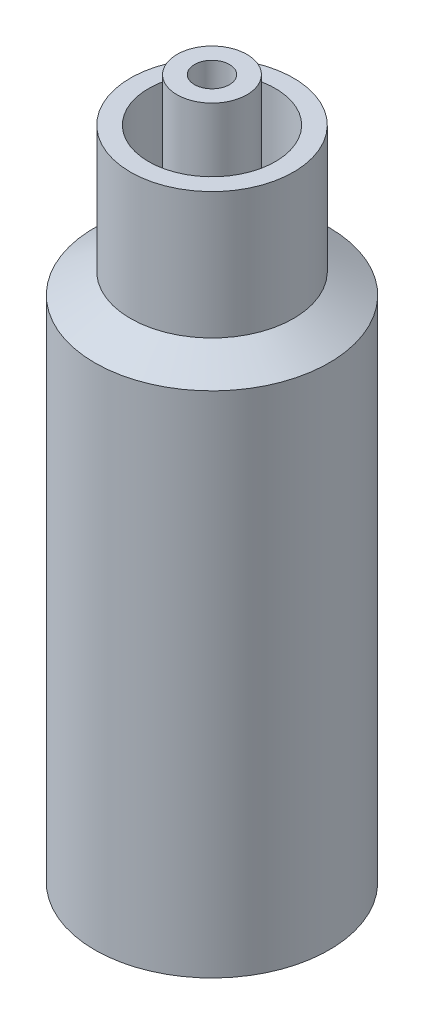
ISO-10303-21;
HEADER;
FILE_DESCRIPTION(('STEP AP214'),'2;1');
FILE_NAME('part.step','',(''),(''),'','','');
FILE_SCHEMA(('AUTOMOTIVE_DESIGN { 1 0 10303 214 1 1 1 1 }'));
ENDSEC;
DATA;
#1=APPLICATION_CONTEXT('core data for automotive mechanical design processes');
#2=APPLICATION_PROTOCOL_DEFINITION('international standard','automotive_design',2000,#1);
#3=PRODUCT_CONTEXT('',#1,'mechanical');
#4=PRODUCT('Part','Part','',(#3));
#5=PRODUCT_RELATED_PRODUCT_CATEGORY('part','',(#4));
#6=PRODUCT_DEFINITION_FORMATION('','',#4);
#7=PRODUCT_DEFINITION_CONTEXT('part definition',#1,'design');
#8=PRODUCT_DEFINITION('design','',#6,#7);
#9=PRODUCT_DEFINITION_SHAPE('','',#8);
#10=(LENGTH_UNIT() NAMED_UNIT(*) SI_UNIT(.MILLI.,.METRE.));
#11=(NAMED_UNIT(*) PLANE_ANGLE_UNIT() SI_UNIT($,.RADIAN.));
#12=(NAMED_UNIT(*) SI_UNIT($,.STERADIAN.) SOLID_ANGLE_UNIT());
#13=UNCERTAINTY_MEASURE_WITH_UNIT(LENGTH_MEASURE(1.E-05),#10,'distance_accuracy_value','');
#14=(GEOMETRIC_REPRESENTATION_CONTEXT(3) GLOBAL_UNCERTAINTY_ASSIGNED_CONTEXT((#13)) GLOBAL_UNIT_ASSIGNED_CONTEXT((#10,
#11,#12)) REPRESENTATION_CONTEXT('',''));
#15=CARTESIAN_POINT('',(0.,0.,0.));
#16=DIRECTION('',(0.,0.,1.));
#17=DIRECTION('',(1.,0.,0.));
#18=AXIS2_PLACEMENT_3D('',#15,#16,#17);
#19=CARTESIAN_POINT('',(-5.715,6.35,0.));
#20=DIRECTION('',(0.,1.,0.));
#21=DIRECTION('',(-1.,0.,0.));
#22=AXIS2_PLACEMENT_3D('',#19,#20,#21);
#23=PLANE('',#22);
#24=CARTESIAN_POINT('',(0.,6.35,0.));
#25=DIRECTION('',(0.,-1.,0.));
#26=DIRECTION('',(1.,0.,0.));
#27=AXIS2_PLACEMENT_3D('',#24,#25,#26);
#28=CIRCLE('',#27,5.715);
#29=CARTESIAN_POINT('',(5.715,6.35,0.));
#30=VERTEX_POINT('',#29);
#31=EDGE_CURVE('E12',#30,#30,#28,.T.);
#32=ORIENTED_EDGE('',*,*,#31,.T.);
#33=EDGE_LOOP('',(#32));
#34=FACE_BOUND('',#33,.T.);
#35=ADVANCED_FACE('F42',(#34),#23,.F.);
#36=CARTESIAN_POINT('',(0.,0.,0.));
#37=DIRECTION('',(0.,-1.,0.));
#38=DIRECTION('',(1.,0.,0.));
#39=AXIS2_PLACEMENT_3D('',#36,#37,#38);
#40=CYLINDRICAL_SURFACE('',#39,5.715);
#41=ORIENTED_EDGE('',*,*,#31,.F.);
#42=EDGE_LOOP('',(#41));
#43=FACE_BOUND('',#42,.T.);
#44=CARTESIAN_POINT('',(0.,10.16,0.));
#45=DIRECTION('',(0.,-1.,0.));
#46=DIRECTION('',(1.,0.,0.));
#47=AXIS2_PLACEMENT_3D('',#44,#45,#46);
#48=CIRCLE('',#47,5.715);
#49=CARTESIAN_POINT('',(5.715,10.16,0.));
#50=VERTEX_POINT('',#49);
#51=EDGE_CURVE('E48',#50,#50,#48,.T.);
#52=ORIENTED_EDGE('',*,*,#51,.T.);
#53=EDGE_LOOP('',(#52));
#54=FACE_BOUND('',#53,.T.);
#55=ADVANCED_FACE('F53',(#43,#54),#40,.T.);
#56=CARTESIAN_POINT('',(0.,12.2400898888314,0.));
#57=DIRECTION('',(0.,-1.,0.));
#58=DIRECTION('',(1.,0.,0.));
#59=AXIS2_PLACEMENT_3D('',#56,#57,#58);
#60=CONICAL_SURFACE('',#59,0.,1.22173047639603);
#61=ORIENTED_EDGE('',*,*,#51,.F.);
#62=EDGE_LOOP('',(#61));
#63=FACE_BOUND('',#62,.T.);
#64=CARTESIAN_POINT('',(0.,12.2400898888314,0.));
#65=VERTEX_POINT('',#64);
#66=VERTEX_LOOP('',#65);
#67=FACE_BOUND('',#66,.T.);
#68=ADVANCED_FACE('F51',(#63,#67),#60,.T.);
#69=CLOSED_SHELL('',(#35,#55,#68));
#70=MANIFOLD_SOLID_BREP('B2',#69);
#71=CARTESIAN_POINT('',(0.,0.,0.));
#72=DIRECTION('',(0.,1.,0.));
#73=DIRECTION('',(0.,0.,1.));
#74=AXIS2_PLACEMENT_3D('',#71,#72,#73);
#75=CYLINDRICAL_SURFACE('',#74,5.7912);
#76=CARTESIAN_POINT('',(0.,28.9522393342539,0.));
#77=DIRECTION('',(0.,1.,0.));
#78=DIRECTION('',(0.,0.,1.));
#79=AXIS2_PLACEMENT_3D('',#76,#77,#78);
#80=CIRCLE('',#79,5.7912);
#81=CARTESIAN_POINT('',(0.,28.9522393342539,-5.7912));
#82=VERTEX_POINT('',#81);
#83=EDGE_CURVE('E124',#82,#82,#80,.T.);
#84=ORIENTED_EDGE('',*,*,#83,.T.);
#85=EDGE_LOOP('',(#84));
#86=FACE_BOUND('',#85,.T.);
#87=CARTESIAN_POINT('',(0.,0.,0.));
#88=DIRECTION('',(0.,1.,0.));
#89=DIRECTION('',(0.,0.,1.));
#90=AXIS2_PLACEMENT_3D('',#87,#88,#89);
#91=CIRCLE('',#90,5.7912);
#92=CARTESIAN_POINT('',(0.,0.,5.7912));
#93=VERTEX_POINT('',#92);
#94=EDGE_CURVE('E41',#93,#93,#91,.T.);
#95=ORIENTED_EDGE('',*,*,#94,.F.);
#96=EDGE_LOOP('',(#95));
#97=FACE_BOUND('',#96,.T.);
#98=ADVANCED_FACE('F84',(#86,#97),#75,.F.);
#99=CARTESIAN_POINT('',(-5.7912,0.,0.));
#100=DIRECTION('',(0.,-1.,0.));
#101=DIRECTION('',(0.,0.,-1.));
#102=AXIS2_PLACEMENT_3D('',#99,#100,#101);
#103=PLANE('',#102);
#104=ORIENTED_EDGE('',*,*,#94,.T.);
#105=EDGE_LOOP('',(#104));
#106=FACE_BOUND('',#105,.T.);
#107=CARTESIAN_POINT('',(0.,0.,0.));
#108=DIRECTION('',(0.,1.,0.));
#109=DIRECTION('',(0.,0.,1.));
#110=AXIS2_PLACEMENT_3D('',#107,#108,#109);
#111=CIRCLE('',#110,6.8072);
#112=CARTESIAN_POINT('',(0.,0.,6.8072));
#113=VERTEX_POINT('',#112);
#114=EDGE_CURVE('E90',#113,#113,#111,.T.);
#115=ORIENTED_EDGE('',*,*,#114,.F.);
#116=EDGE_LOOP('',(#115));
#117=FACE_BOUND('',#116,.T.);
#118=ADVANCED_FACE('F142',(#106,#117),#103,.T.);
#119=CARTESIAN_POINT('',(0.,0.,0.));
#120=DIRECTION('',(0.,1.,0.));
#121=DIRECTION('',(0.,0.,1.));
#122=AXIS2_PLACEMENT_3D('',#119,#120,#121);
#123=CYLINDRICAL_SURFACE('',#122,6.8072);
#124=ORIENTED_EDGE('',*,*,#114,.T.);
#125=EDGE_LOOP('',(#124));
#126=FACE_BOUND('',#125,.T.);
#127=CARTESIAN_POINT('',(0.,29.5388272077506,0.));
#128=DIRECTION('',(0.,1.,0.));
#129=DIRECTION('',(0.,0.,1.));
#130=AXIS2_PLACEMENT_3D('',#127,#128,#129);
#131=CIRCLE('',#130,6.8072);
#132=CARTESIAN_POINT('',(0.,29.5388272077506,6.8072));
#133=VERTEX_POINT('',#132);
#134=EDGE_CURVE('E94',#133,#133,#131,.T.);
#135=ORIENTED_EDGE('',*,*,#134,.F.);
#136=EDGE_LOOP('',(#135));
#137=FACE_BOUND('',#136,.T.);
#138=ADVANCED_FACE('F146',(#126,#137),#123,.T.);
#139=CARTESIAN_POINT('',(0.,30.734,0.));
#140=DIRECTION('',(0.,-1.,0.));
#141=DIRECTION('',(0.,0.,-1.));
#142=AXIS2_PLACEMENT_3D('',#139,#140,#141);
#143=CONICAL_SURFACE('',#142,4.7371,1.0471975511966);
#144=ORIENTED_EDGE('',*,*,#134,.T.);
#145=EDGE_LOOP('',(#144));
#146=FACE_BOUND('',#145,.T.);
#147=CARTESIAN_POINT('',(0.,30.734,0.));
#148=DIRECTION('',(0.,1.,0.));
#149=DIRECTION('',(0.,0.,1.));
#150=AXIS2_PLACEMENT_3D('',#147,#148,#149);
#151=CIRCLE('',#150,4.7371);
#152=CARTESIAN_POINT('',(0.,30.734,4.7371));
#153=VERTEX_POINT('',#152);
#154=EDGE_CURVE('E98',#153,#153,#151,.T.);
#155=ORIENTED_EDGE('',*,*,#154,.F.);
#156=EDGE_LOOP('',(#155));
#157=FACE_BOUND('',#156,.T.);
#158=ADVANCED_FACE('F150',(#146,#157),#143,.T.);
#159=CARTESIAN_POINT('',(0.,0.,0.));
#160=DIRECTION('',(0.,1.,0.));
#161=DIRECTION('',(0.,0.,1.));
#162=AXIS2_PLACEMENT_3D('',#159,#160,#161);
#163=CYLINDRICAL_SURFACE('',#162,4.7371);
#164=ORIENTED_EDGE('',*,*,#154,.T.);
#165=EDGE_LOOP('',(#164));
#166=FACE_BOUND('',#165,.T.);
#167=CARTESIAN_POINT('',(0.,38.1,0.));
#168=DIRECTION('',(0.,1.,0.));
#169=DIRECTION('',(0.,0.,1.));
#170=AXIS2_PLACEMENT_3D('',#167,#168,#169);
#171=CIRCLE('',#170,4.7371);
#172=CARTESIAN_POINT('',(0.,38.1,4.7371));
#173=VERTEX_POINT('',#172);
#174=EDGE_CURVE('E103',#173,#173,#171,.T.);
#175=ORIENTED_EDGE('',*,*,#174,.F.);
#176=EDGE_LOOP('',(#175));
#177=FACE_BOUND('',#176,.T.);
#178=ADVANCED_FACE('F156',(#166,#177),#163,.T.);
#179=CARTESIAN_POINT('',(-4.7371,38.1,0.));
#180=DIRECTION('',(0.,1.,0.));
#181=DIRECTION('',(0.,0.,1.));
#182=AXIS2_PLACEMENT_3D('',#179,#180,#181);
#183=PLANE('',#182);
#184=ORIENTED_EDGE('',*,*,#174,.T.);
#185=EDGE_LOOP('',(#184));
#186=FACE_BOUND('',#185,.T.);
#187=CARTESIAN_POINT('',(0.,38.1,0.));
#188=DIRECTION('',(0.,1.,0.));
#189=DIRECTION('',(0.,0.,1.));
#190=AXIS2_PLACEMENT_3D('',#187,#188,#189);
#191=CIRCLE('',#190,3.683);
#192=CARTESIAN_POINT('',(0.,38.1,3.683));
#193=VERTEX_POINT('',#192);
#194=EDGE_CURVE('E106',#193,#193,#191,.T.);
#195=ORIENTED_EDGE('',*,*,#194,.F.);
#196=EDGE_LOOP('',(#195));
#197=FACE_BOUND('',#196,.T.);
#198=ADVANCED_FACE('F160',(#186,#197),#183,.T.);
#199=CARTESIAN_POINT('',(0.,0.,0.));
#200=DIRECTION('',(0.,1.,0.));
#201=DIRECTION('',(0.,0.,1.));
#202=AXIS2_PLACEMENT_3D('',#199,#200,#201);
#203=CYLINDRICAL_SURFACE('',#202,3.683);
#204=ORIENTED_EDGE('',*,*,#194,.T.);
#205=EDGE_LOOP('',(#204));
#206=FACE_BOUND('',#205,.T.);
#207=CARTESIAN_POINT('',(0.,31.3425849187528,0.));
#208=DIRECTION('',(0.,1.,0.));
#209=DIRECTION('',(0.,0.,1.));
#210=AXIS2_PLACEMENT_3D('',#207,#208,#209);
#211=CIRCLE('',#210,3.683);
#212=CARTESIAN_POINT('',(0.,31.3425849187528,3.683));
#213=VERTEX_POINT('',#212);
#214=EDGE_CURVE('E109',#213,#213,#211,.T.);
#215=ORIENTED_EDGE('',*,*,#214,.F.);
#216=EDGE_LOOP('',(#215));
#217=FACE_BOUND('',#216,.T.);
#218=ADVANCED_FACE('F164',(#206,#217),#203,.F.);
#219=CARTESIAN_POINT('',(0.,32.2957902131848,0.));
#220=DIRECTION('',(0.,-1.,0.));
#221=DIRECTION('',(0.,0.,-1.));
#222=AXIS2_PLACEMENT_3D('',#219,#220,#221);
#223=CONICAL_SURFACE('',#222,2.032,1.0471975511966);
#224=ORIENTED_EDGE('',*,*,#214,.T.);
#225=EDGE_LOOP('',(#224));
#226=FACE_BOUND('',#225,.T.);
#227=CARTESIAN_POINT('',(0.,32.2957902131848,0.));
#228=DIRECTION('',(0.,1.,0.));
#229=DIRECTION('',(0.,0.,1.));
#230=AXIS2_PLACEMENT_3D('',#227,#228,#229);
#231=CIRCLE('',#230,2.032);
#232=CARTESIAN_POINT('',(0.,32.2957902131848,2.032));
#233=VERTEX_POINT('',#232);
#234=EDGE_CURVE('E112',#233,#233,#231,.T.);
#235=ORIENTED_EDGE('',*,*,#234,.F.);
#236=EDGE_LOOP('',(#235));
#237=FACE_BOUND('',#236,.T.);
#238=ADVANCED_FACE('F168',(#226,#237),#223,.T.);
#239=CARTESIAN_POINT('',(0.,0.,0.));
#240=DIRECTION('',(0.,1.,0.));
#241=DIRECTION('',(0.,0.,1.));
#242=AXIS2_PLACEMENT_3D('',#239,#240,#241);
#243=CYLINDRICAL_SURFACE('',#242,2.032);
#244=ORIENTED_EDGE('',*,*,#234,.T.);
#245=EDGE_LOOP('',(#244));
#246=FACE_BOUND('',#245,.T.);
#247=CARTESIAN_POINT('',(0.,40.64,0.));
#248=DIRECTION('',(0.,1.,0.));
#249=DIRECTION('',(0.,0.,1.));
#250=AXIS2_PLACEMENT_3D('',#247,#248,#249);
#251=CIRCLE('',#250,2.032);
#252=CARTESIAN_POINT('',(0.,40.64,2.032));
#253=VERTEX_POINT('',#252);
#254=EDGE_CURVE('E115',#253,#253,#251,.T.);
#255=ORIENTED_EDGE('',*,*,#254,.F.);
#256=EDGE_LOOP('',(#255));
#257=FACE_BOUND('',#256,.T.);
#258=ADVANCED_FACE('F172',(#246,#257),#243,.T.);
#259=CARTESIAN_POINT('',(-2.032,40.64,0.));
#260=DIRECTION('',(0.,1.,0.));
#261=DIRECTION('',(0.,0.,1.));
#262=AXIS2_PLACEMENT_3D('',#259,#260,#261);
#263=PLANE('',#262);
#264=ORIENTED_EDGE('',*,*,#254,.T.);
#265=EDGE_LOOP('',(#264));
#266=FACE_BOUND('',#265,.T.);
#267=CARTESIAN_POINT('',(0.,40.64,0.));
#268=DIRECTION('',(0.,1.,0.));
#269=DIRECTION('',(0.,0.,1.));
#270=AXIS2_PLACEMENT_3D('',#267,#268,#269);
#271=CIRCLE('',#270,1.016);
#272=CARTESIAN_POINT('',(0.,40.64,1.016));
#273=VERTEX_POINT('',#272);
#274=EDGE_CURVE('E118',#273,#273,#271,.T.);
#275=ORIENTED_EDGE('',*,*,#274,.F.);
#276=EDGE_LOOP('',(#275));
#277=FACE_BOUND('',#276,.T.);
#278=ADVANCED_FACE('F138',(#266,#277),#263,.T.);
#279=CARTESIAN_POINT('',(0.,0.,0.));
#280=DIRECTION('',(0.,1.,0.));
#281=DIRECTION('',(0.,0.,1.));
#282=AXIS2_PLACEMENT_3D('',#279,#280,#281);
#283=CYLINDRICAL_SURFACE('',#282,1.016);
#284=ORIENTED_EDGE('',*,*,#274,.T.);
#285=EDGE_LOOP('',(#284));
#286=FACE_BOUND('',#285,.T.);
#287=CARTESIAN_POINT('',(0.,31.7092023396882,0.));
#288=DIRECTION('',(0.,1.,0.));
#289=DIRECTION('',(0.,0.,1.));
#290=AXIS2_PLACEMENT_3D('',#287,#288,#289);
#291=CIRCLE('',#290,1.016);
#292=CARTESIAN_POINT('',(0.,31.7092023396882,-1.016));
#293=VERTEX_POINT('',#292);
#294=EDGE_CURVE('E121',#293,#293,#291,.T.);
#295=ORIENTED_EDGE('',*,*,#294,.F.);
#296=EDGE_LOOP('',(#295));
#297=FACE_BOUND('',#296,.T.);
#298=ADVANCED_FACE('F132',(#286,#297),#283,.F.);
#299=CARTESIAN_POINT('',(0.,28.9522393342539,0.));
#300=DIRECTION('',(0.,-1.,0.));
#301=DIRECTION('',(0.,0.,-1.));
#302=AXIS2_PLACEMENT_3D('',#299,#300,#301);
#303=CONICAL_SURFACE('',#302,5.7912,1.0471975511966);
#304=CARTESIAN_POINT('',(0.,31.7092023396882,-1.016));
#305=CARTESIAN_POINT('',(0.,31.6804839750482,-1.06574166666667));
#306=CARTESIAN_POINT('',(0.,31.6517656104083,-1.11548333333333));
#307=CARTESIAN_POINT('',(0.,31.5943288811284,-1.21496666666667));
#308=CARTESIAN_POINT('',(0.,31.5656105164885,-1.26470833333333));
#309=CARTESIAN_POINT('',(0.,31.5081737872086,-1.36419166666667));
#310=CARTESIAN_POINT('',(0.,31.4794554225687,-1.41393333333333));
#311=CARTESIAN_POINT('',(0.,31.4220186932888,-1.51341666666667));
#312=CARTESIAN_POINT('',(0.,31.3933003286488,-1.56315833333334));
#313=CARTESIAN_POINT('',(0.,31.335863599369,-1.66264166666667));
#314=CARTESIAN_POINT('',(0.,31.307145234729,-1.71238333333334));
#315=CARTESIAN_POINT('',(0.,31.2497085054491,-1.81186666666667));
#316=CARTESIAN_POINT('',(0.,31.2209901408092,-1.86160833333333));
#317=CARTESIAN_POINT('',(0.,31.1635534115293,-1.96109166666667));
#318=CARTESIAN_POINT('',(0.,31.1348350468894,-2.01083333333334));
#319=CARTESIAN_POINT('',(0.,31.0773983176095,-2.11031666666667));
#320=CARTESIAN_POINT('',(0.,31.0486799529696,-2.16005833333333));
#321=CARTESIAN_POINT('',(0.,30.9912432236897,-2.25954166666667));
#322=CARTESIAN_POINT('',(0.,30.9625248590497,-2.30928333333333));
#323=CARTESIAN_POINT('',(0.,30.9050881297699,-2.40876666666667));
#324=CARTESIAN_POINT('',(0.,30.8763697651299,-2.45850833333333));
#325=CARTESIAN_POINT('',(0.,30.81893303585,-2.55799166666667));
#326=CARTESIAN_POINT('',(0.,30.7902146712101,-2.60773333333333));
#327=CARTESIAN_POINT('',(0.,30.7327779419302,-2.70721666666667));
#328=CARTESIAN_POINT('',(0.,30.7040595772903,-2.75695833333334));
#329=CARTESIAN_POINT('',(0.,30.6466228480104,-2.85644166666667));
#330=CARTESIAN_POINT('',(0.,30.6179044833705,-2.90618333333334));
#331=CARTESIAN_POINT('',(0.,30.5604677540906,-3.00566666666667));
#332=CARTESIAN_POINT('',(0.,30.5317493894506,-3.05540833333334));
#333=CARTESIAN_POINT('',(0.,30.4743126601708,-3.15489166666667));
#334=CARTESIAN_POINT('',(0.,30.4455942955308,-3.20463333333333));
#335=CARTESIAN_POINT('',(0.,30.3881575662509,-3.30411666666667));
#336=CARTESIAN_POINT('',(0.,30.359439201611,-3.35385833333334));
#337=CARTESIAN_POINT('',(0.,30.3020024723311,-3.45334166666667));
#338=CARTESIAN_POINT('',(0.,30.2732841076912,-3.50308333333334));
#339=CARTESIAN_POINT('',(0.,30.2158473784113,-3.60256666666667));
#340=CARTESIAN_POINT('',(0.,30.1871290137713,-3.65230833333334));
#341=CARTESIAN_POINT('',(0.,30.1296922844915,-3.75179166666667));
#342=CARTESIAN_POINT('',(0.,30.1009739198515,-3.80153333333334));
#343=CARTESIAN_POINT('',(0.,30.0435371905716,-3.90101666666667));
#344=CARTESIAN_POINT('',(0.,30.0148188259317,-3.95075833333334));
#345=CARTESIAN_POINT('',(0.,29.9573820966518,-4.05024166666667));
#346=CARTESIAN_POINT('',(0.,29.9286637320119,-4.09998333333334));
#347=CARTESIAN_POINT('',(0.,29.871227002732,-4.19946666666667));
#348=CARTESIAN_POINT('',(0.,29.8425086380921,-4.24920833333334));
#349=CARTESIAN_POINT('',(0.,29.7850719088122,-4.34869166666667));
#350=CARTESIAN_POINT('',(0.,29.7563535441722,-4.39843333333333));
#351=CARTESIAN_POINT('',(0.,29.6989168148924,-4.49791666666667));
#352=CARTESIAN_POINT('',(0.,29.6701984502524,-4.54765833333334));
#353=CARTESIAN_POINT('',(0.,29.6127617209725,-4.64714166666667));
#354=CARTESIAN_POINT('',(0.,29.5840433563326,-4.69688333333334));
#355=CARTESIAN_POINT('',(0.,29.5266066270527,-4.79636666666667));
#356=CARTESIAN_POINT('',(0.,29.4978882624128,-4.84610833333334));
#357=CARTESIAN_POINT('',(0.,29.4404515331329,-4.94559166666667));
#358=CARTESIAN_POINT('',(0.,29.411733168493,-4.99533333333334));
#359=CARTESIAN_POINT('',(0.,29.3542964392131,-5.09481666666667));
#360=CARTESIAN_POINT('',(0.,29.3255780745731,-5.14455833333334));
#361=CARTESIAN_POINT('',(0.,29.2681413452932,-5.24404166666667));
#362=CARTESIAN_POINT('',(0.,29.2394229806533,-5.29378333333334));
#363=CARTESIAN_POINT('',(0.,29.1819862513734,-5.39326666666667));
#364=CARTESIAN_POINT('',(0.,29.1532678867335,-5.44300833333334));
#365=CARTESIAN_POINT('',(0.,29.0958311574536,-5.54249166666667));
#366=CARTESIAN_POINT('',(0.,29.0671127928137,-5.59223333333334));
#367=CARTESIAN_POINT('',(0.,29.0096760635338,-5.69171666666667));
#368=CARTESIAN_POINT('',(0.,28.9809576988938,-5.74145833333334));
#369=CARTESIAN_POINT('',(0.,28.9522393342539,-5.7912));
#370=B_SPLINE_CURVE_WITH_KNOTS('',3,(#304,#305,#306,#307,#308,#309,#310,#311,#312,#313,#314,
#315,#316,#317,#318,#319,#320,#321,#322,#323,#324,#325,#326,#327,#328,#329,#330,#331,#332,#333,
#334,#335,#336,#337,#338,#339,#340,#341,#342,#343,#344,#345,#346,#347,#348,#349,#350,#351,#352,
#353,#354,#355,#356,#357,#358,#359,#360,#361,#362,#363,#364,#365,#366,#367,#368,#369),
.UNSPECIFIED.,.F.,.F.,(4,2,2,2,2,2,2,2,2,2,2,2,2,2,2,2,2,2,2,2,2,2,2,2,2,2,2,2,2,2,2,2,4),(0.,
0.172310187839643,0.344620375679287,0.51693056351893,0.689240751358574,0.861550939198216,
1.03386112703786,1.2061713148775,1.37848150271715,1.55079169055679,1.72310187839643,
1.89541206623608,2.06772225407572,2.24003244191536,2.41234262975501,2.58465281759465,
2.7569630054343,2.92927319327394,3.10158338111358,3.27389356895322,3.44620375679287,
3.61851394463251,3.79082413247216,3.9631343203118,4.13544450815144,4.30775469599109,
4.48006488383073,4.65237507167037,4.82468525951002,4.99699544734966,5.1693056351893,
5.34161582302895,5.51392601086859),.UNSPECIFIED.);
#371=EDGE_CURVE('BSEAM130',#293,#82,#370,.T.);
#372=ORIENTED_EDGE('',*,*,#294,.T.);
#373=ORIENTED_EDGE('',*,*,#83,.F.);
#374=ORIENTED_EDGE('',*,*,#371,.T.);
#375=ORIENTED_EDGE('',*,*,#371,.F.);
#376=EDGE_LOOP('',(#372,#374,#373,#375));
#377=FACE_BOUND('',#376,.T.);
#378=ADVANCED_FACE('F130',(#377),#303,.F.);
#379=CLOSED_SHELL('',(#98,#118,#138,#158,#178,#198,#218,#238,#258,#278,#298,#378));
#380=MANIFOLD_SOLID_BREP('B6',#379);
#381=ADVANCED_BREP_SHAPE_REPRESENTATION('',(#18,#70,#380),#14);
#382=SHAPE_DEFINITION_REPRESENTATION(#9,#381);
ENDSEC;
END-ISO-10303-21;
